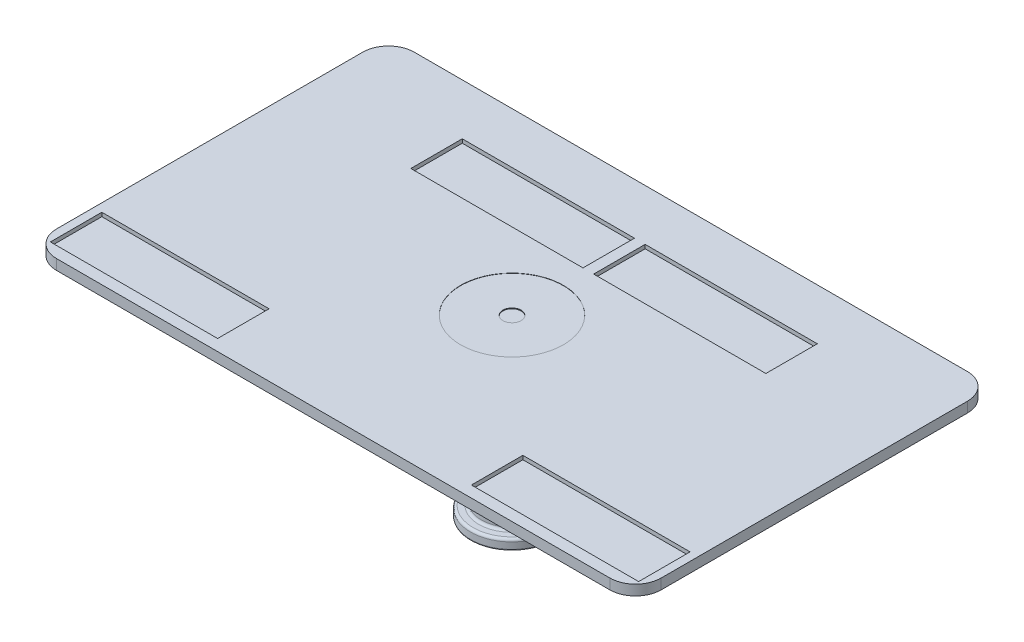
from build123d import *

# Parameters (mm, degrees)
SKETCH1_W            = 23.5
SKETCH1_H            = 13.9
SKETCH1_R            = 2
SKETCH1_W_2          = 13.8
SKETCH1_H_2          = 2
SKETCH1_W_3          = 6.5
BOSS_EXTRUDE3_DEPTH  = 0.4
SKETCH4_R            = 2
SKETCH4_R_2          = 0.354056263
BOSS_EXTRUDE5_DEPTH  = 0.39
SKETCH5_R            = 2
BOSS_EXTRUDE6_DEPTH  = 0.36
SKETCH6_W            = 0.415356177
SKETCH6_H            = 2
BOSS_EXTRUDE7_DEPTH  = 0.4
SKETCH7_W            = 6.692321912
SKETCH7_H            = 2
SKETCH7_W_2          = 6.692321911
SKETCH7_W_3          = 6.5
BOSS_EXTRUDE8_DEPTH  = 0.25
SKETCH8_R            = 1.192564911
BOSS_EXTRUDE9_DEPTH  = 6
SKETCH9_R            = 1.609699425
BOSS_EXTRUDE10_DEPTH = 0.4
FILLET2_R            = 0.1
FILLET3_R            = 0.05
FILLET4_R            = 1


with BuildPart() as part:
    # Sketch1 → Boss-Extrude3 (new body)
    with BuildSketch(Plane(origin=(0, 0, 0), x_dir=(1, 0, 0), z_dir=(0, 1, 0))):
        with Locations((0.853857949, 0)):
            Rectangle(SKETCH1_W, SKETCH1_H)
        with Locations(Location((0.853857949, 0, 0), (0, 0, 270))):
            Circle(SKETCH1_R, mode=Mode.SUBTRACT)
        with Locations((0.853857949, 3.966939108)):
            Rectangle(SKETCH1_W_2, SKETCH1_H_2, mode=Mode.SUBTRACT)
        with Locations((-7.32784737, -5.509639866)):
            Rectangle(SKETCH1_W_3, SKETCH1_H_2, mode=Mode.SUBTRACT)
        with Locations((9.035563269, -5.509639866)):
            Rectangle(SKETCH1_W_3, SKETCH1_H_2, mode=Mode.SUBTRACT)
    extrude(amount=BOSS_EXTRUDE3_DEPTH)

    # Sketch4 → Boss-Extrude5 (add)
    with BuildSketch(Plane(origin=(0, 0, 0), x_dir=(1, 0, 0), z_dir=(0, 1, 0))):
        with Locations(Location((0.853857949, 0, 0), (0, 0, 270))):
            Circle(SKETCH4_R)
        with Locations(Location((0.853857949, 0, 0), (0, 0, 270))):
            Circle(SKETCH4_R_2, mode=Mode.SUBTRACT)
    extrude(amount=BOSS_EXTRUDE5_DEPTH)

    # Sketch5 → Boss-Extrude6 (add)
    with BuildSketch(Plane(origin=(0, 0, 0), x_dir=(1, 0, 0), z_dir=(0, 1, 0))):
        with Locations(Location((0.853857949, 0, 0), (0, 0, 270))):
            Circle(SKETCH5_R)
    extrude(amount=BOSS_EXTRUDE6_DEPTH)

    # Sketch6 → Boss-Extrude7 (add)
    with BuildSketch(Plane(origin=(0, 0, 0), x_dir=(1, 0, 0), z_dir=(0, 1, 0))):
        with Locations((0.85385795, 3.966939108)):
            Rectangle(SKETCH6_W, SKETCH6_H)
    extrude(amount=BOSS_EXTRUDE7_DEPTH)

    # Sketch7 → Boss-Extrude8 (add)
    with BuildSketch(Plane(origin=(0, 0, 0), x_dir=(1, 0, 0), z_dir=(0, 1, 0))):
        with Locations((-2.699981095, 3.966939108)):
            Rectangle(SKETCH7_W, SKETCH7_H)
        with Locations((4.407696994, 3.966939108)):
            Rectangle(SKETCH7_W_2, SKETCH7_H)
        with Locations((-7.32784737, -5.509639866)):
            Rectangle(SKETCH7_W_3, SKETCH7_H)
        with Locations((9.035563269, -5.509639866)):
            Rectangle(SKETCH7_W_3, SKETCH7_H)
    extrude(amount=BOSS_EXTRUDE8_DEPTH)

    # Sketch8 → Boss-Extrude9 (add)
    with BuildSketch(Plane.XZ):
        with Locations(Location((0.853857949, 0, 0), (0, 0, 90))):
            Circle(SKETCH8_R)
    extrude(amount=BOSS_EXTRUDE9_DEPTH)

    # Sketch9 → Boss-Extrude10 (add)
    with BuildSketch(Plane.XZ.offset(6)):
        with Locations(Location((0.853857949, 0, 0), (0, 0, 270))):
            Circle(SKETCH9_R)
    extrude(amount=BOSS_EXTRUDE10_DEPTH)

    # Fillet2
    fillet2_edges = [part.edges().sort_by_distance(p)[0] for p in [
        (0.853857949, -6, -1.192564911),
        (0.853857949, -6, 1.609699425),
    ]]
    fillet(fillet2_edges, radius=FILLET2_R)

    # Fillet3
    fillet3_edges = [part.edges().sort_by_distance(p)[0] for p in [
        (0.853857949, -6.4, 1.609699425),
    ]]
    fillet(fillet3_edges, radius=FILLET3_R)

    # Fillet4
    fillet4_edges = [part.edges().sort_by_distance(p)[0] for p in [
        (12.603857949, 0.2, -6.95),
        (12.603857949, 0.2, 6.95),
        (-10.896142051, 0.2, 6.95),
        (-10.896142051, 0.2, -6.95),
    ]]
    fillet(fillet4_edges, radius=FILLET4_R)


solid = part.part
